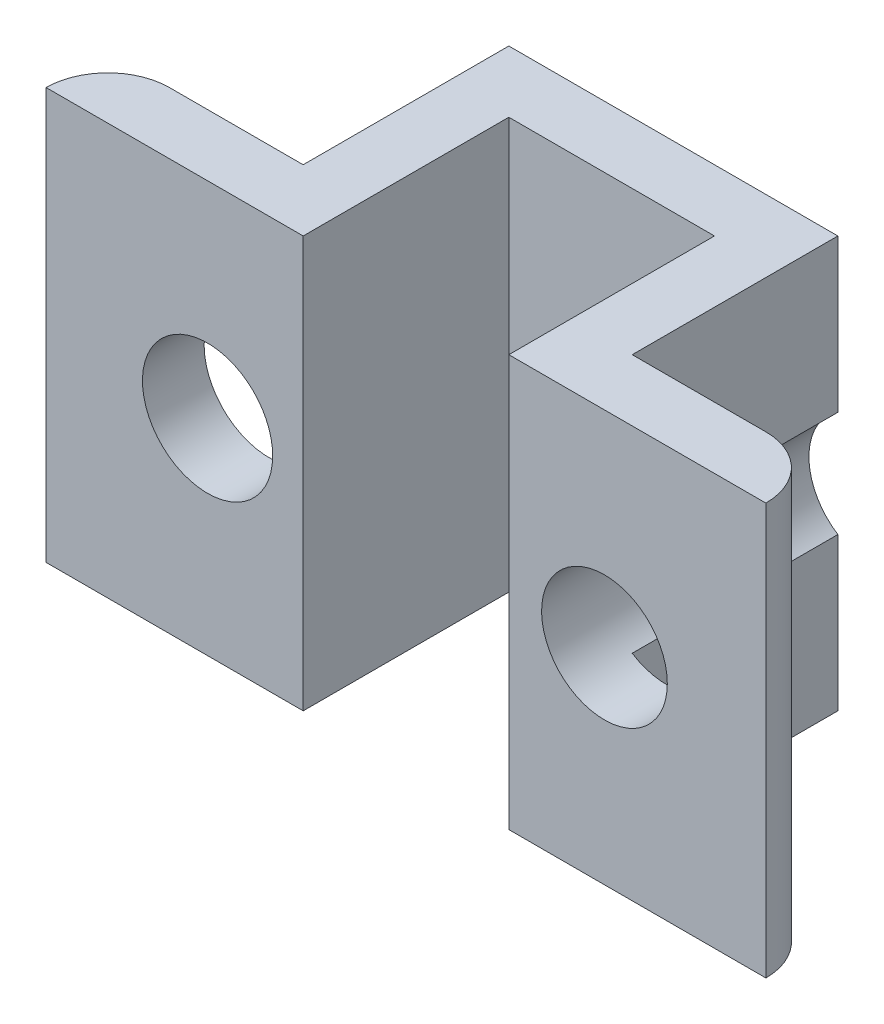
ISO-10303-21;
HEADER;
FILE_DESCRIPTION(('STEP AP214'),'2;1');
FILE_NAME('part.step','',(''),(''),'','','');
FILE_SCHEMA(('AUTOMOTIVE_DESIGN { 1 0 10303 214 1 1 1 1 }'));
ENDSEC;
DATA;
#1=APPLICATION_CONTEXT('core data for automotive mechanical design processes');
#2=APPLICATION_PROTOCOL_DEFINITION('international standard','automotive_design',2000,#1);
#3=PRODUCT_CONTEXT('',#1,'mechanical');
#4=PRODUCT('Part','Part','',(#3));
#5=PRODUCT_RELATED_PRODUCT_CATEGORY('part','',(#4));
#6=PRODUCT_DEFINITION_FORMATION('','',#4);
#7=PRODUCT_DEFINITION_CONTEXT('part definition',#1,'design');
#8=PRODUCT_DEFINITION('design','',#6,#7);
#9=PRODUCT_DEFINITION_SHAPE('','',#8);
#10=(LENGTH_UNIT() NAMED_UNIT(*) SI_UNIT(.MILLI.,.METRE.));
#11=(NAMED_UNIT(*) PLANE_ANGLE_UNIT() SI_UNIT($,.RADIAN.));
#12=(NAMED_UNIT(*) SI_UNIT($,.STERADIAN.) SOLID_ANGLE_UNIT());
#13=UNCERTAINTY_MEASURE_WITH_UNIT(LENGTH_MEASURE(1.E-05),#10,'distance_accuracy_value','');
#14=(GEOMETRIC_REPRESENTATION_CONTEXT(3) GLOBAL_UNCERTAINTY_ASSIGNED_CONTEXT((#13)) GLOBAL_UNIT_ASSIGNED_CONTEXT((#10,
#11,#12)) REPRESENTATION_CONTEXT('',''));
#15=CARTESIAN_POINT('',(0.,0.,0.));
#16=DIRECTION('',(0.,0.,1.));
#17=DIRECTION('',(1.,0.,0.));
#18=AXIS2_PLACEMENT_3D('',#15,#16,#17);
#19=CARTESIAN_POINT('',(0.,0.,20.));
#20=DIRECTION('',(0.,0.,1.));
#21=DIRECTION('',(1.,0.,0.));
#22=AXIS2_PLACEMENT_3D('',#19,#20,#21);
#23=PLANE('',#22);
#24=DIRECTION('',(0.,1.,0.));
#25=VECTOR('',#24,1.);
#26=CARTESIAN_POINT('',(-5.,-9.99999999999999,20.));
#27=LINE('',#26,#25);
#28=CARTESIAN_POINT('',(-5.,-9.99999999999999,20.));
#29=VERTEX_POINT('',#28);
#30=CARTESIAN_POINT('',(-5.,10.,20.));
#31=VERTEX_POINT('',#30);
#32=EDGE_CURVE('E220',#29,#31,#27,.T.);
#33=ORIENTED_EDGE('',*,*,#32,.T.);
#34=DIRECTION('',(-1.,0.,0.));
#35=VECTOR('',#34,1.);
#36=CARTESIAN_POINT('',(-17.5,10.,20.));
#37=LINE('',#36,#35);
#38=CARTESIAN_POINT('',(-17.5,10.,20.));
#39=VERTEX_POINT('',#38);
#40=EDGE_CURVE('E237',#31,#39,#37,.T.);
#41=ORIENTED_EDGE('',*,*,#40,.T.);
#42=DIRECTION('',(0.,-1.,0.));
#43=VECTOR('',#42,1.);
#44=CARTESIAN_POINT('',(-17.5,10.,20.));
#45=LINE('',#44,#43);
#46=CARTESIAN_POINT('',(-17.5,-9.99999999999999,20.));
#47=VERTEX_POINT('',#46);
#48=EDGE_CURVE('E241',#39,#47,#45,.T.);
#49=ORIENTED_EDGE('',*,*,#48,.T.);
#50=DIRECTION('',(1.,0.,0.));
#51=VECTOR('',#50,1.);
#52=CARTESIAN_POINT('',(-17.5,-9.99999999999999,20.));
#53=LINE('',#52,#51);
#54=EDGE_CURVE('E244',#47,#29,#53,.T.);
#55=ORIENTED_EDGE('',*,*,#54,.T.);
#56=EDGE_LOOP('',(#33,#41,#49,#55));
#57=FACE_BOUND('',#56,.T.);
#58=CARTESIAN_POINT('',(-9.65000000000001,0.,20.));
#59=DIRECTION('',(0.,0.,1.));
#60=DIRECTION('',(1.,0.,0.));
#61=AXIS2_PLACEMENT_3D('',#58,#59,#60);
#62=CIRCLE('',#61,3.16595147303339);
#63=CARTESIAN_POINT('',(-6.48404852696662,0.,20.));
#64=VERTEX_POINT('',#63);
#65=EDGE_CURVE('E231',#64,#64,#62,.T.);
#66=ORIENTED_EDGE('',*,*,#65,.F.);
#67=EDGE_LOOP('',(#66));
#68=FACE_BOUND('',#67,.T.);
#69=ADVANCED_FACE('F34',(#57,#68),#23,.T.);
#70=DIRECTION('',(0.,1.,0.));
#71=VECTOR('',#70,1.);
#72=CARTESIAN_POINT('',(5.,-9.99999999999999,20.));
#73=LINE('',#72,#71);
#74=CARTESIAN_POINT('',(5.,-9.99999999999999,20.));
#75=VERTEX_POINT('',#74);
#76=CARTESIAN_POINT('',(5.,10.,20.));
#77=VERTEX_POINT('',#76);
#78=EDGE_CURVE('E213',#75,#77,#73,.T.);
#79=ORIENTED_EDGE('',*,*,#78,.F.);
#80=CARTESIAN_POINT('',(17.5,-10.,20.));
#81=VERTEX_POINT('',#80);
#82=EDGE_CURVE('E243',#75,#81,#53,.T.);
#83=ORIENTED_EDGE('',*,*,#82,.T.);
#84=DIRECTION('',(0.,1.,0.));
#85=VECTOR('',#84,1.);
#86=CARTESIAN_POINT('',(17.5,10.,20.));
#87=LINE('',#86,#85);
#88=CARTESIAN_POINT('',(17.5,10.,20.));
#89=VERTEX_POINT('',#88);
#90=EDGE_CURVE('E234',#81,#89,#87,.T.);
#91=ORIENTED_EDGE('',*,*,#90,.T.);
#92=EDGE_CURVE('E238',#89,#77,#37,.T.);
#93=ORIENTED_EDGE('',*,*,#92,.T.);
#94=EDGE_LOOP('',(#79,#83,#91,#93));
#95=FACE_BOUND('',#94,.T.);
#96=CARTESIAN_POINT('',(9.65,0.,20.));
#97=DIRECTION('',(0.,0.,1.));
#98=DIRECTION('',(1.,0.,0.));
#99=AXIS2_PLACEMENT_3D('',#96,#97,#98);
#100=CIRCLE('',#99,3.05678073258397);
#101=CARTESIAN_POINT('',(12.706780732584,0.,20.));
#102=VERTEX_POINT('',#101);
#103=EDGE_CURVE('E223',#102,#102,#100,.T.);
#104=ORIENTED_EDGE('',*,*,#103,.F.);
#105=EDGE_LOOP('',(#104));
#106=FACE_BOUND('',#105,.T.);
#107=ADVANCED_FACE('F299',(#95,#106),#23,.T.);
#108=CARTESIAN_POINT('',(-17.5,10.,20.));
#109=DIRECTION('',(0.,-1.,0.));
#110=DIRECTION('',(0.,0.,-1.));
#111=AXIS2_PLACEMENT_3D('',#108,#109,#110);
#112=PLANE('',#111);
#113=ORIENTED_EDGE('',*,*,#92,.F.);
#114=CARTESIAN_POINT('',(14.5,10.,20.));
#115=DIRECTION('',(0.,-1.,0.));
#116=DIRECTION('',(0.,0.,-1.));
#117=AXIS2_PLACEMENT_3D('',#114,#115,#116);
#118=CIRCLE('',#117,3.);
#119=CARTESIAN_POINT('',(14.5,10.,17.));
#120=VERTEX_POINT('',#119);
#121=EDGE_CURVE('E56',#89,#120,#118,.F.);
#122=ORIENTED_EDGE('',*,*,#121,.T.);
#123=DIRECTION('',(1.,0.,0.));
#124=VECTOR('',#123,1.);
#125=CARTESIAN_POINT('',(0.,10.,17.));
#126=LINE('',#125,#124);
#127=CARTESIAN_POINT('',(8.,10.,17.));
#128=VERTEX_POINT('',#127);
#129=EDGE_CURVE('E189',#128,#120,#126,.T.);
#130=ORIENTED_EDGE('',*,*,#129,.F.);
#131=DIRECTION('',(0.,0.,1.));
#132=VECTOR('',#131,1.);
#133=CARTESIAN_POINT('',(7.99999999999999,10.,0.));
#134=LINE('',#133,#132);
#135=CARTESIAN_POINT('',(8.,10.,7.));
#136=VERTEX_POINT('',#135);
#137=EDGE_CURVE('E186',#136,#128,#134,.T.);
#138=ORIENTED_EDGE('',*,*,#137,.F.);
#139=DIRECTION('',(1.,0.,0.));
#140=VECTOR('',#139,1.);
#141=CARTESIAN_POINT('',(0.,10.,7.));
#142=LINE('',#141,#140);
#143=CARTESIAN_POINT('',(-8.,10.,7.));
#144=VERTEX_POINT('',#143);
#145=EDGE_CURVE('E183',#144,#136,#142,.T.);
#146=ORIENTED_EDGE('',*,*,#145,.F.);
#147=DIRECTION('',(0.,0.,-1.));
#148=VECTOR('',#147,1.);
#149=CARTESIAN_POINT('',(-8.,10.,0.));
#150=LINE('',#149,#148);
#151=CARTESIAN_POINT('',(-8.,10.,17.0013710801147));
#152=VERTEX_POINT('',#151);
#153=EDGE_CURVE('E173',#152,#144,#150,.T.);
#154=ORIENTED_EDGE('',*,*,#153,.F.);
#155=DIRECTION('',(1.,0.,0.));
#156=VECTOR('',#155,1.);
#157=CARTESIAN_POINT('',(0.,10.,17.0013710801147));
#158=LINE('',#157,#156);
#159=CARTESIAN_POINT('',(-14.5000003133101,10.,17.0013710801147));
#160=VERTEX_POINT('',#159);
#161=EDGE_CURVE('E176',#160,#152,#158,.T.);
#162=ORIENTED_EDGE('',*,*,#161,.F.);
#163=CARTESIAN_POINT('',(-14.5000003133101,10.,20.0013710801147));
#164=DIRECTION('',(0.,-1.,0.));
#165=DIRECTION('',(0.,0.,-1.));
#166=AXIS2_PLACEMENT_3D('',#163,#164,#165);
#167=CIRCLE('',#166,3.);
#168=EDGE_CURVE('E264',#160,#39,#167,.F.);
#169=ORIENTED_EDGE('',*,*,#168,.T.);
#170=ORIENTED_EDGE('',*,*,#40,.F.);
#171=DIRECTION('',(0.,0.,1.));
#172=VECTOR('',#171,1.);
#173=CARTESIAN_POINT('',(-5.,10.,20.));
#174=LINE('',#173,#172);
#175=CARTESIAN_POINT('',(-5.,10.,10.));
#176=VERTEX_POINT('',#175);
#177=EDGE_CURVE('E207',#176,#31,#174,.T.);
#178=ORIENTED_EDGE('',*,*,#177,.F.);
#179=DIRECTION('',(-1.,0.,0.));
#180=VECTOR('',#179,1.);
#181=CARTESIAN_POINT('',(-5.,10.,10.));
#182=LINE('',#181,#180);
#183=CARTESIAN_POINT('',(5.,10.,10.));
#184=VERTEX_POINT('',#183);
#185=EDGE_CURVE('E216',#184,#176,#182,.T.);
#186=ORIENTED_EDGE('',*,*,#185,.F.);
#187=DIRECTION('',(0.,0.,-1.));
#188=VECTOR('',#187,1.);
#189=CARTESIAN_POINT('',(5.,10.,20.));
#190=LINE('',#189,#188);
#191=EDGE_CURVE('E202',#77,#184,#190,.T.);
#192=ORIENTED_EDGE('',*,*,#191,.F.);
#193=EDGE_LOOP('',(#113,#122,#130,#138,#146,#154,#162,#169,#170,#178,#186,#192));
#194=FACE_BOUND('',#193,.T.);
#195=ADVANCED_FACE('F281',(#194),#112,.F.);
#196=CARTESIAN_POINT('',(-17.5,-9.99999999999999,20.));
#197=DIRECTION('',(0.,1.,0.));
#198=DIRECTION('',(-1.,0.,0.));
#199=AXIS2_PLACEMENT_3D('',#196,#197,#198);
#200=PLANE('',#199);
#201=DIRECTION('',(1.,0.,0.));
#202=VECTOR('',#201,1.);
#203=CARTESIAN_POINT('',(0.,-9.99999999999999,17.));
#204=LINE('',#203,#202);
#205=CARTESIAN_POINT('',(8.,-10.,17.));
#206=VERTEX_POINT('',#205);
#207=CARTESIAN_POINT('',(14.5,-9.99999999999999,17.));
#208=VERTEX_POINT('',#207);
#209=EDGE_CURVE('E168',#206,#208,#204,.T.);
#210=ORIENTED_EDGE('',*,*,#209,.T.);
#211=CARTESIAN_POINT('',(14.5,-10.,20.));
#212=DIRECTION('',(0.,1.,0.));
#213=DIRECTION('',(-1.,0.,0.));
#214=AXIS2_PLACEMENT_3D('',#211,#212,#213);
#215=CIRCLE('',#214,3.);
#216=EDGE_CURVE('E11',#208,#81,#215,.F.);
#217=ORIENTED_EDGE('',*,*,#216,.T.);
#218=ORIENTED_EDGE('',*,*,#82,.F.);
#219=DIRECTION('',(0.,0.,-1.));
#220=VECTOR('',#219,1.);
#221=CARTESIAN_POINT('',(5.,-9.99999999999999,20.));
#222=LINE('',#221,#220);
#223=CARTESIAN_POINT('',(5.,-10.,10.));
#224=VERTEX_POINT('',#223);
#225=EDGE_CURVE('E203',#75,#224,#222,.T.);
#226=ORIENTED_EDGE('',*,*,#225,.T.);
#227=DIRECTION('',(-1.,0.,0.));
#228=VECTOR('',#227,1.);
#229=CARTESIAN_POINT('',(-5.,-9.99999999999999,10.));
#230=LINE('',#229,#228);
#231=CARTESIAN_POINT('',(-5.,-9.99999999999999,10.));
#232=VERTEX_POINT('',#231);
#233=EDGE_CURVE('E206',#224,#232,#230,.T.);
#234=ORIENTED_EDGE('',*,*,#233,.T.);
#235=DIRECTION('',(0.,0.,1.));
#236=VECTOR('',#235,1.);
#237=CARTESIAN_POINT('',(-5.,-9.99999999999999,20.));
#238=LINE('',#237,#236);
#239=EDGE_CURVE('E210',#232,#29,#238,.T.);
#240=ORIENTED_EDGE('',*,*,#239,.T.);
#241=ORIENTED_EDGE('',*,*,#54,.F.);
#242=CARTESIAN_POINT('',(-14.5000003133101,-9.99999999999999,20.0013710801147));
#243=DIRECTION('',(0.,1.,0.));
#244=DIRECTION('',(-1.,0.,0.));
#245=AXIS2_PLACEMENT_3D('',#242,#243,#244);
#246=CIRCLE('',#245,3.);
#247=CARTESIAN_POINT('',(-14.5000003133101,-9.99999999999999,17.0013710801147));
#248=VERTEX_POINT('',#247);
#249=EDGE_CURVE('E266',#47,#248,#246,.F.);
#250=ORIENTED_EDGE('',*,*,#249,.T.);
#251=DIRECTION('',(1.,0.,0.));
#252=VECTOR('',#251,1.);
#253=CARTESIAN_POINT('',(0.,-9.99999999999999,17.0013710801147));
#254=LINE('',#253,#252);
#255=CARTESIAN_POINT('',(-8.,-9.99999999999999,17.0013710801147));
#256=VERTEX_POINT('',#255);
#257=EDGE_CURVE('E180',#248,#256,#254,.T.);
#258=ORIENTED_EDGE('',*,*,#257,.T.);
#259=DIRECTION('',(0.,0.,-1.));
#260=VECTOR('',#259,1.);
#261=CARTESIAN_POINT('',(-8.,-9.99999999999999,0.));
#262=LINE('',#261,#260);
#263=CARTESIAN_POINT('',(-8.,-9.99999999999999,7.));
#264=VERTEX_POINT('',#263);
#265=EDGE_CURVE('E172',#256,#264,#262,.T.);
#266=ORIENTED_EDGE('',*,*,#265,.T.);
#267=DIRECTION('',(1.,0.,0.));
#268=VECTOR('',#267,1.);
#269=CARTESIAN_POINT('',(0.,-9.99999999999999,7.));
#270=LINE('',#269,#268);
#271=CARTESIAN_POINT('',(8.,-9.99999999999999,7.));
#272=VERTEX_POINT('',#271);
#273=EDGE_CURVE('E151',#264,#272,#270,.T.);
#274=ORIENTED_EDGE('',*,*,#273,.T.);
#275=DIRECTION('',(0.,0.,1.));
#276=VECTOR('',#275,1.);
#277=CARTESIAN_POINT('',(7.99999999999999,-9.99999999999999,0.));
#278=LINE('',#277,#276);
#279=EDGE_CURVE('E163',#272,#206,#278,.T.);
#280=ORIENTED_EDGE('',*,*,#279,.T.);
#281=EDGE_LOOP('',(#210,#217,#218,#226,#234,#240,#241,#250,#258,#266,#274,#280));
#282=FACE_BOUND('',#281,.T.);
#283=ADVANCED_FACE('F170',(#282),#200,.F.);
#284=CARTESIAN_POINT('',(-9.65000000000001,0.,20.));
#285=DIRECTION('',(0.,0.,-1.));
#286=DIRECTION('',(-1.,0.,0.));
#287=AXIS2_PLACEMENT_3D('',#284,#285,#286);
#288=CYLINDRICAL_SURFACE('',#287,3.16595147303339);
#289=CARTESIAN_POINT('',(-9.65000000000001,0.,7.));
#290=DIRECTION('',(0.,0.,1.));
#291=DIRECTION('',(1.,0.,0.));
#292=AXIS2_PLACEMENT_3D('',#289,#290,#291);
#293=CIRCLE('',#292,3.16595147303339);
#294=CARTESIAN_POINT('',(-8.,-2.70198977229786,7.));
#295=VERTEX_POINT('',#294);
#296=CARTESIAN_POINT('',(-8.,2.70198977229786,7.));
#297=VERTEX_POINT('',#296);
#298=EDGE_CURVE('E194',#295,#297,#293,.T.);
#299=ORIENTED_EDGE('',*,*,#298,.F.);
#300=DIRECTION('',(0.,0.,-1.));
#301=VECTOR('',#300,1.);
#302=CARTESIAN_POINT('',(-8.,-2.70198977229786,20.));
#303=LINE('',#302,#301);
#304=CARTESIAN_POINT('',(-8.,-2.70198977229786,17.0013710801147));
#305=VERTEX_POINT('',#304);
#306=EDGE_CURVE('E259',#305,#295,#303,.T.);
#307=ORIENTED_EDGE('',*,*,#306,.F.);
#308=CARTESIAN_POINT('',(-9.65000000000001,0.,17.0013710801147));
#309=DIRECTION('',(0.,0.,1.));
#310=DIRECTION('',(1.,0.,0.));
#311=AXIS2_PLACEMENT_3D('',#308,#309,#310);
#312=CIRCLE('',#311,3.16595147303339);
#313=CARTESIAN_POINT('',(-8.,2.70198977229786,17.0013710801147));
#314=VERTEX_POINT('',#313);
#315=EDGE_CURVE('E254',#314,#305,#312,.T.);
#316=ORIENTED_EDGE('',*,*,#315,.F.);
#317=DIRECTION('',(0.,0.,-1.));
#318=VECTOR('',#317,1.);
#319=CARTESIAN_POINT('',(-8.,2.70198977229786,20.));
#320=LINE('',#319,#318);
#321=EDGE_CURVE('E256',#297,#314,#320,.F.);
#322=ORIENTED_EDGE('',*,*,#321,.F.);
#323=EDGE_LOOP('',(#299,#307,#316,#322));
#324=FACE_BOUND('',#323,.T.);
#325=ORIENTED_EDGE('',*,*,#65,.T.);
#326=EDGE_LOOP('',(#325));
#327=FACE_BOUND('',#326,.T.);
#328=ADVANCED_FACE('F327',(#324,#327),#288,.F.);
#329=CARTESIAN_POINT('',(9.65,0.,20.));
#330=DIRECTION('',(0.,0.,-1.));
#331=DIRECTION('',(-1.,0.,0.));
#332=AXIS2_PLACEMENT_3D('',#329,#330,#331);
#333=CYLINDRICAL_SURFACE('',#332,3.05678073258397);
#334=DIRECTION('',(0.,0.,-1.));
#335=VECTOR('',#334,1.);
#336=CARTESIAN_POINT('',(8.,2.57320975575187,20.));
#337=LINE('',#336,#335);
#338=CARTESIAN_POINT('',(8.,2.57320975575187,17.));
#339=VERTEX_POINT('',#338);
#340=CARTESIAN_POINT('',(8.,2.57320975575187,7.));
#341=VERTEX_POINT('',#340);
#342=EDGE_CURVE('E252',#339,#341,#337,.T.);
#343=ORIENTED_EDGE('',*,*,#342,.F.);
#344=CARTESIAN_POINT('',(9.65,0.,17.));
#345=DIRECTION('',(0.,0.,1.));
#346=DIRECTION('',(1.,0.,0.));
#347=AXIS2_PLACEMENT_3D('',#344,#345,#346);
#348=CIRCLE('',#347,3.05678073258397);
#349=CARTESIAN_POINT('',(8.,-2.57320975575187,17.));
#350=VERTEX_POINT('',#349);
#351=EDGE_CURVE('E249',#350,#339,#348,.T.);
#352=ORIENTED_EDGE('',*,*,#351,.F.);
#353=DIRECTION('',(0.,0.,-1.));
#354=VECTOR('',#353,1.);
#355=CARTESIAN_POINT('',(8.,-2.57320975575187,20.));
#356=LINE('',#355,#354);
#357=CARTESIAN_POINT('',(8.,-2.57320975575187,7.));
#358=VERTEX_POINT('',#357);
#359=EDGE_CURVE('E247',#358,#350,#356,.F.);
#360=ORIENTED_EDGE('',*,*,#359,.F.);
#361=CARTESIAN_POINT('',(9.65,0.,7.));
#362=DIRECTION('',(0.,0.,1.));
#363=DIRECTION('',(1.,0.,0.));
#364=AXIS2_PLACEMENT_3D('',#361,#362,#363);
#365=CIRCLE('',#364,3.05678073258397);
#366=EDGE_CURVE('E155',#341,#358,#365,.T.);
#367=ORIENTED_EDGE('',*,*,#366,.F.);
#368=EDGE_LOOP('',(#343,#352,#360,#367));
#369=FACE_BOUND('',#368,.T.);
#370=ORIENTED_EDGE('',*,*,#103,.T.);
#371=EDGE_LOOP('',(#370));
#372=FACE_BOUND('',#371,.T.);
#373=ADVANCED_FACE('F310',(#369,#372),#333,.F.);
#374=CARTESIAN_POINT('',(-5.,-9.99999999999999,20.));
#375=DIRECTION('',(-1.,0.,0.));
#376=DIRECTION('',(0.,0.,1.));
#377=AXIS2_PLACEMENT_3D('',#374,#375,#376);
#378=PLANE('',#377);
#379=ORIENTED_EDGE('',*,*,#177,.T.);
#380=ORIENTED_EDGE('',*,*,#32,.F.);
#381=ORIENTED_EDGE('',*,*,#239,.F.);
#382=DIRECTION('',(0.,1.,0.));
#383=VECTOR('',#382,1.);
#384=CARTESIAN_POINT('',(-5.,-9.99999999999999,10.));
#385=LINE('',#384,#383);
#386=EDGE_CURVE('E224',#232,#176,#385,.T.);
#387=ORIENTED_EDGE('',*,*,#386,.T.);
#388=EDGE_LOOP('',(#379,#380,#381,#387));
#389=FACE_BOUND('',#388,.T.);
#390=ADVANCED_FACE('F288',(#389),#378,.F.);
#391=CARTESIAN_POINT('',(-5.,-9.99999999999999,10.));
#392=DIRECTION('',(0.,0.,-1.));
#393=DIRECTION('',(-1.,0.,0.));
#394=AXIS2_PLACEMENT_3D('',#391,#392,#393);
#395=PLANE('',#394);
#396=ORIENTED_EDGE('',*,*,#185,.T.);
#397=ORIENTED_EDGE('',*,*,#386,.F.);
#398=ORIENTED_EDGE('',*,*,#233,.F.);
#399=DIRECTION('',(0.,1.,0.));
#400=VECTOR('',#399,1.);
#401=CARTESIAN_POINT('',(5.,-9.99999999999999,10.));
#402=LINE('',#401,#400);
#403=EDGE_CURVE('E226',#224,#184,#402,.T.);
#404=ORIENTED_EDGE('',*,*,#403,.T.);
#405=EDGE_LOOP('',(#396,#397,#398,#404));
#406=FACE_BOUND('',#405,.T.);
#407=ADVANCED_FACE('F292',(#406),#395,.F.);
#408=CARTESIAN_POINT('',(5.,-9.99999999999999,20.));
#409=DIRECTION('',(1.,0.,0.));
#410=DIRECTION('',(0.,0.,-1.));
#411=AXIS2_PLACEMENT_3D('',#408,#409,#410);
#412=PLANE('',#411);
#413=ORIENTED_EDGE('',*,*,#191,.T.);
#414=ORIENTED_EDGE('',*,*,#403,.F.);
#415=ORIENTED_EDGE('',*,*,#225,.F.);
#416=ORIENTED_EDGE('',*,*,#78,.T.);
#417=EDGE_LOOP('',(#413,#414,#415,#416));
#418=FACE_BOUND('',#417,.T.);
#419=ADVANCED_FACE('F294',(#418),#412,.F.);
#420=CARTESIAN_POINT('',(-8.,-9.99999999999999,0.));
#421=DIRECTION('',(1.,0.,0.));
#422=DIRECTION('',(0.,0.,-1.));
#423=AXIS2_PLACEMENT_3D('',#420,#421,#422);
#424=PLANE('',#423);
#425=ORIENTED_EDGE('',*,*,#306,.T.);
#426=DIRECTION('',(0.,1.,0.));
#427=VECTOR('',#426,1.);
#428=CARTESIAN_POINT('',(-8.,-9.99999999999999,7.));
#429=LINE('',#428,#427);
#430=EDGE_CURVE('E192',#264,#295,#429,.T.);
#431=ORIENTED_EDGE('',*,*,#430,.F.);
#432=ORIENTED_EDGE('',*,*,#265,.F.);
#433=DIRECTION('',(0.,1.,0.));
#434=VECTOR('',#433,1.);
#435=CARTESIAN_POINT('',(-8.,-9.99999999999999,17.0013710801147));
#436=LINE('',#435,#434);
#437=EDGE_CURVE('E196',#256,#305,#436,.T.);
#438=ORIENTED_EDGE('',*,*,#437,.T.);
#439=EDGE_LOOP('',(#425,#431,#432,#438));
#440=FACE_BOUND('',#439,.T.);
#441=ADVANCED_FACE('F325',(#440),#424,.F.);
#442=CARTESIAN_POINT('',(7.99999999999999,-9.99999999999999,0.));
#443=DIRECTION('',(-1.,0.,0.));
#444=DIRECTION('',(0.,0.,1.));
#445=AXIS2_PLACEMENT_3D('',#442,#443,#444);
#446=PLANE('',#445);
#447=ORIENTED_EDGE('',*,*,#342,.T.);
#448=DIRECTION('',(0.,1.,0.));
#449=VECTOR('',#448,1.);
#450=CARTESIAN_POINT('',(8.,-9.99999999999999,7.));
#451=LINE('',#450,#449);
#452=EDGE_CURVE('E159',#341,#136,#451,.T.);
#453=ORIENTED_EDGE('',*,*,#452,.T.);
#454=ORIENTED_EDGE('',*,*,#137,.T.);
#455=DIRECTION('',(0.,1.,0.));
#456=VECTOR('',#455,1.);
#457=CARTESIAN_POINT('',(8.,-9.99999999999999,17.));
#458=LINE('',#457,#456);
#459=EDGE_CURVE('E158',#339,#128,#458,.T.);
#460=ORIENTED_EDGE('',*,*,#459,.F.);
#461=EDGE_LOOP('',(#447,#453,#454,#460));
#462=FACE_BOUND('',#461,.T.);
#463=ADVANCED_FACE('F313',(#462),#446,.F.);
#464=CARTESIAN_POINT('',(0.,-9.99999999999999,7.));
#465=DIRECTION('',(0.,0.,1.));
#466=DIRECTION('',(1.,0.,0.));
#467=AXIS2_PLACEMENT_3D('',#464,#465,#466);
#468=PLANE('',#467);
#469=ORIENTED_EDGE('',*,*,#298,.T.);
#470=EDGE_CURVE('E195',#297,#144,#429,.T.);
#471=ORIENTED_EDGE('',*,*,#470,.T.);
#472=ORIENTED_EDGE('',*,*,#145,.T.);
#473=ORIENTED_EDGE('',*,*,#452,.F.);
#474=ORIENTED_EDGE('',*,*,#366,.T.);
#475=EDGE_CURVE('E146',#272,#358,#451,.T.);
#476=ORIENTED_EDGE('',*,*,#475,.F.);
#477=ORIENTED_EDGE('',*,*,#273,.F.);
#478=ORIENTED_EDGE('',*,*,#430,.T.);
#479=EDGE_LOOP('',(#469,#471,#472,#473,#474,#476,#477,#478));
#480=FACE_BOUND('',#479,.T.);
#481=ADVANCED_FACE('F148',(#480),#468,.F.);
#482=ORIENTED_EDGE('',*,*,#321,.T.);
#483=EDGE_CURVE('E199',#314,#152,#436,.T.);
#484=ORIENTED_EDGE('',*,*,#483,.T.);
#485=ORIENTED_EDGE('',*,*,#153,.T.);
#486=ORIENTED_EDGE('',*,*,#470,.F.);
#487=EDGE_LOOP('',(#482,#484,#485,#486));
#488=FACE_BOUND('',#487,.T.);
#489=ADVANCED_FACE('F319',(#488),#424,.F.);
#490=CARTESIAN_POINT('',(0.,-9.99999999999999,17.0013710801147));
#491=DIRECTION('',(0.,0.,1.));
#492=DIRECTION('',(1.,0.,0.));
#493=AXIS2_PLACEMENT_3D('',#490,#491,#492);
#494=PLANE('',#493);
#495=ORIENTED_EDGE('',*,*,#257,.F.);
#496=DIRECTION('',(0.,-1.,0.));
#497=VECTOR('',#496,1.);
#498=CARTESIAN_POINT('',(-14.5000003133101,-9.99999999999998,17.0013710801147));
#499=LINE('',#498,#497);
#500=EDGE_CURVE('E261',#248,#160,#499,.F.);
#501=ORIENTED_EDGE('',*,*,#500,.T.);
#502=ORIENTED_EDGE('',*,*,#161,.T.);
#503=ORIENTED_EDGE('',*,*,#483,.F.);
#504=ORIENTED_EDGE('',*,*,#315,.T.);
#505=ORIENTED_EDGE('',*,*,#437,.F.);
#506=EDGE_LOOP('',(#495,#501,#502,#503,#504,#505));
#507=FACE_BOUND('',#506,.T.);
#508=ADVANCED_FACE('F276',(#507),#494,.F.);
#509=CARTESIAN_POINT('',(0.,-9.99999999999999,17.));
#510=DIRECTION('',(0.,0.,1.));
#511=DIRECTION('',(1.,0.,0.));
#512=AXIS2_PLACEMENT_3D('',#509,#510,#511);
#513=PLANE('',#512);
#514=ORIENTED_EDGE('',*,*,#129,.T.);
#515=DIRECTION('',(0.,1.,0.));
#516=VECTOR('',#515,1.);
#517=CARTESIAN_POINT('',(14.5,-9.99999999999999,17.));
#518=LINE('',#517,#516);
#519=EDGE_CURVE('E42',#120,#208,#518,.F.);
#520=ORIENTED_EDGE('',*,*,#519,.T.);
#521=ORIENTED_EDGE('',*,*,#209,.F.);
#522=EDGE_CURVE('E166',#206,#350,#458,.T.);
#523=ORIENTED_EDGE('',*,*,#522,.T.);
#524=ORIENTED_EDGE('',*,*,#351,.T.);
#525=ORIENTED_EDGE('',*,*,#459,.T.);
#526=EDGE_LOOP('',(#514,#520,#521,#523,#524,#525));
#527=FACE_BOUND('',#526,.T.);
#528=ADVANCED_FACE('F305',(#527),#513,.F.);
#529=ORIENTED_EDGE('',*,*,#359,.T.);
#530=ORIENTED_EDGE('',*,*,#522,.F.);
#531=ORIENTED_EDGE('',*,*,#279,.F.);
#532=ORIENTED_EDGE('',*,*,#475,.T.);
#533=EDGE_LOOP('',(#529,#530,#531,#532));
#534=FACE_BOUND('',#533,.T.);
#535=ADVANCED_FACE('F164',(#534),#446,.F.);
#536=CARTESIAN_POINT('',(-14.5000003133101,10.,20.0013710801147));
#537=DIRECTION('',(0.,-1.,0.));
#538=DIRECTION('',(1.,0.,0.));
#539=AXIS2_PLACEMENT_3D('',#536,#537,#538);
#540=CYLINDRICAL_SURFACE('',#539,3.);
#541=ORIENTED_EDGE('',*,*,#249,.F.);
#542=ORIENTED_EDGE('',*,*,#48,.F.);
#543=ORIENTED_EDGE('',*,*,#168,.F.);
#544=ORIENTED_EDGE('',*,*,#500,.F.);
#545=EDGE_LOOP('',(#541,#542,#543,#544));
#546=FACE_BOUND('',#545,.T.);
#547=ADVANCED_FACE('F278',(#546),#540,.T.);
#548=CARTESIAN_POINT('',(14.5,10.,20.));
#549=DIRECTION('',(0.,1.,0.));
#550=DIRECTION('',(0.,0.,1.));
#551=AXIS2_PLACEMENT_3D('',#548,#549,#550);
#552=CYLINDRICAL_SURFACE('',#551,3.);
#553=ORIENTED_EDGE('',*,*,#216,.F.);
#554=ORIENTED_EDGE('',*,*,#519,.F.);
#555=ORIENTED_EDGE('',*,*,#121,.F.);
#556=ORIENTED_EDGE('',*,*,#90,.F.);
#557=EDGE_LOOP('',(#553,#554,#555,#556));
#558=FACE_BOUND('',#557,.T.);
#559=ADVANCED_FACE('F36',(#558),#552,.T.);
#560=CLOSED_SHELL('',(#69,#107,#195,#283,#328,#373,#390,#407,#419,#441,#463,#481,#489,#508,#528,
#535,#547,#559));
#561=MANIFOLD_SOLID_BREP('B2',#560);
#562=ADVANCED_BREP_SHAPE_REPRESENTATION('',(#18,#561),#14);
#563=SHAPE_DEFINITION_REPRESENTATION(#9,#562);
ENDSEC;
END-ISO-10303-21;
